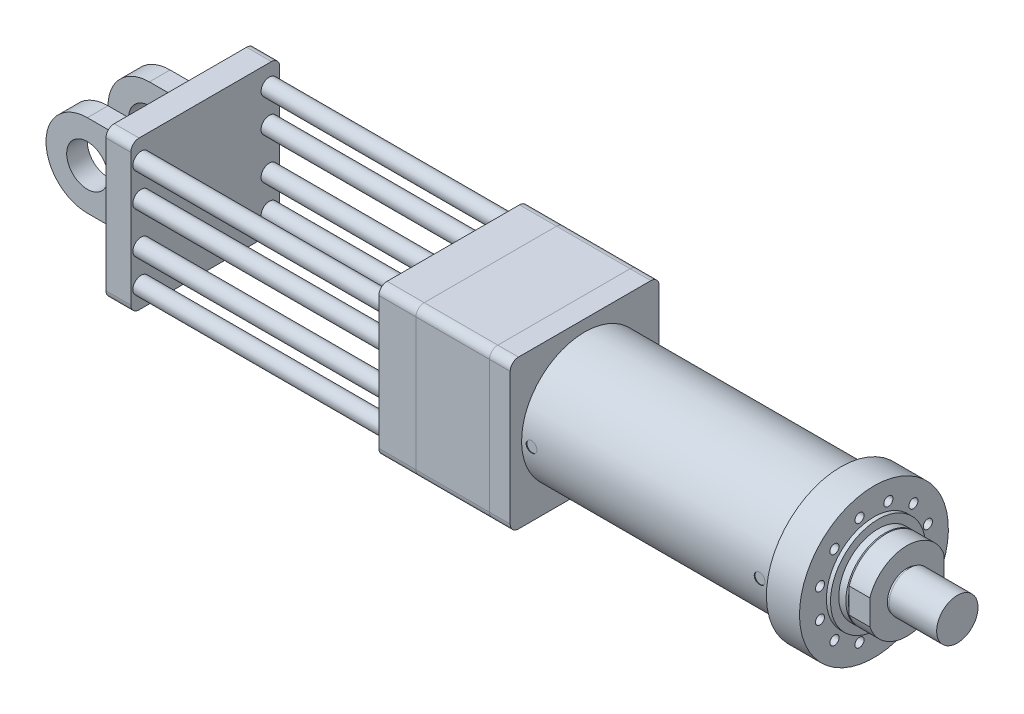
from build123d import *

# Parameters (mm, degrees)
SKETCH_2_W          = 619.5
SKETCH_2_H          = 152.5
SKETCH_3_R          = 180
SKETCH_3_R_2        = 11
EXTRUDE_1_DEPTH     = 80
SKETCH_4_R          = 115
EXTRUDE_2_DEPTH     = 10
SKETCH_5_R          = 95
EXTRUDE_3_DEPTH     = 20
CHAMFER_1_SIZE      = 3
SKETCH_17_R         = 13
CUT_EXTRUDE_6_DEPTH = 2
SKETCH_19_R         = 13
CUT_EXTRUDE_7_DEPTH = 2
SKETCH_23_W         = 360
SKETCH_23_H         = 360
EXTRUDE_8_DEPTH     = 50
EXTRUDE_9_DEPTH     = 50
SKETCH_25_R         = 47.5
EXTRUDE_10_DEPTH    = 5
SKETCH_26_R         = 50
EXTRUDE_11_DEPTH    = 115
SKETCH_28_W         = 360
SKETCH_28_H         = 360
EXTRUDE_12_DEPTH    = 178
SKETCH_29_W         = 360
SKETCH_29_H         = 360
EXTRUDE_13_DEPTH    = 89.5
FILLET_1_R          = 20
FILLET_2_R          = 20
FILLET_3_R          = 20
SKETCH_30_R         = 20
EXTRUDE_14_DEPTH    = 600
SKETCH_31_W         = 360
SKETCH_31_H         = 360
EXTRUDE_15_DEPTH    = 60
FILLET_4_R          = 20
SKETCH_32_W         = 50
SKETCH_32_H         = 200
EXTRUDE_16_DEPTH    = 225
SKETCH_33_R         = 50
CUT_EXTRUDE_8_DEPTH = 225


with BuildPart() as part:
    # Sketch 2 → Revolve 1 (revolve)
    with BuildSketch(Plane.XY):
        with Locations((309.75, 76.25)):
            Rectangle(SKETCH_2_W, SKETCH_2_H)
    revolve(axis=Axis((619.5, 0, 0), (-1, 0, 0)))

    # Sketch 3 → Extrude 1 (add)
    with BuildSketch(Plane(origin=(619.5, 0, 0), x_dir=(0, 0, -1), z_dir=(1, 0, 0))):
        with Locations(Location((0, 0, 0), (0, 0, 90))):
            Circle(SKETCH_3_R)
        with Locations(Location((130.399986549, 34.940571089, 0), (0, 0, 90))):
            Circle(SKETCH_3_R_2, mode=Mode.SUBTRACT)
        with Locations(Location((130.399986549, -34.940571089, 0), (0, 0, 90))):
            Circle(SKETCH_3_R_2, mode=Mode.SUBTRACT)
        with Locations(Location((95.45941546, -95.45941546, 0), (0, 0, 90))):
            Circle(SKETCH_3_R_2, mode=Mode.SUBTRACT)
        with Locations(Location((34.940571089, -130.399986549, 0), (0, 0, 90))):
            Circle(SKETCH_3_R_2, mode=Mode.SUBTRACT)
        with Locations(Location((-34.940571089, -130.399986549, 0), (0, 0, 90))):
            Circle(SKETCH_3_R_2, mode=Mode.SUBTRACT)
        with Locations(Location((-95.45941546, -95.45941546, 0), (0, 0, 90))):
            Circle(SKETCH_3_R_2, mode=Mode.SUBTRACT)
        with Locations(Location((-130.399986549, -34.940571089, 0), (0, 0, 90))):
            Circle(SKETCH_3_R_2, mode=Mode.SUBTRACT)
        with Locations(Location((-130.399986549, 34.940571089, 0), (0, 0, 90))):
            Circle(SKETCH_3_R_2, mode=Mode.SUBTRACT)
        with Locations(Location((-95.45941546, 95.45941546, 0), (0, 0, 90))):
            Circle(SKETCH_3_R_2, mode=Mode.SUBTRACT)
        with Locations(Location((-34.940571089, 130.399986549, 0), (0, 0, 90))):
            Circle(SKETCH_3_R_2, mode=Mode.SUBTRACT)
        with Locations(Location((34.940571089, 130.399986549, 0), (0, 0, 90))):
            Circle(SKETCH_3_R_2, mode=Mode.SUBTRACT)
        with Locations(Location((95.45941546, 95.45941546, 0), (0, 0, 90))):
            Circle(SKETCH_3_R_2, mode=Mode.SUBTRACT)
    extrude(amount=EXTRUDE_1_DEPTH)

    # Sketch 4 → Extrude 2 (add)
    with BuildSketch(Plane(origin=(699.5, 0, 0), x_dir=(0, 0, -1), z_dir=(1, 0, 0))):
        with Locations(Location((0, 0, 0), (0, 0, 90))):
            Circle(SKETCH_4_R)
    extrude(amount=EXTRUDE_2_DEPTH)

    # Sketch 5 → Extrude 3 (add)
    with BuildSketch(Plane(origin=(709.5, 0, 0), x_dir=(0, 0, -1), z_dir=(1, 0, 0))):
        with Locations(Location((0, 0, 0), (0, 0, 90))):
            Circle(SKETCH_5_R)
    extrude(amount=EXTRUDE_3_DEPTH)

    # Chamfer 1
    chamfer_1_edges = [part.edges().sort_by_distance(p)[0] for p in [
        (729.5, -95, 0),
    ]]
    chamfer(chamfer_1_edges, length=CHAMFER_1_SIZE)

    # Sketch 17 → Cut-Extrude 6 (cut)
    with BuildSketch(Plane.XY.offset(-152.5)):
        with Locations(Location((44, 0, 0), (0, 0, 180))):
            Circle(SKETCH_17_R)
    extrude(amount=CUT_EXTRUDE_6_DEPTH, mode=Mode.SUBTRACT)

    # Sketch 19 → Cut-Extrude 7 (cut)
    with BuildSketch(Plane.XY.offset(152.5)):
        with Locations((24, 0)):
            Circle(SKETCH_19_R)
        with Locations((575.5, 0)):
            Circle(SKETCH_19_R)
    extrude(amount=-CUT_EXTRUDE_7_DEPTH, mode=Mode.SUBTRACT)

    # Sketch 23 → Extrude 8 (add)
    with BuildSketch(Plane.ZY):
        Rectangle(SKETCH_23_W, SKETCH_23_H)
    extrude(amount=EXTRUDE_8_DEPTH)

    # Sketch 24 → Extrude 9 (add)
    with BuildSketch(Plane(origin=(729.5, 0, 0), x_dir=(0, 0, -1), z_dir=(1, 0, 0))):
        with BuildLine():
            Line((-90, 30.413812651), (-90, -30.413812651))
            ThreePointArc((-90, -30.413812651), (0, -95), (90, -30.413812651))
            Line((90, -30.413812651), (90, 30.413812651))
            ThreePointArc((90, 30.413812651), (0, 95), (-90, 30.413812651))
        make_face()
    extrude(amount=EXTRUDE_9_DEPTH)

    # Sketch 25 → Extrude 10 (add)
    with BuildSketch(Plane(origin=(779.5, 0, 0), x_dir=(0, 0, -1), z_dir=(1, 0, 0))):
        with Locations(Location((0, 0, 0), (0, 0, 90))):
            Circle(SKETCH_25_R)
    extrude(amount=EXTRUDE_10_DEPTH)

    # Sketch 26 → Extrude 11 (add)
    with BuildSketch(Plane(origin=(784.5, 0, 0), x_dir=(0, 0, -1), z_dir=(1, 0, 0))):
        with Locations(Location((1.643994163, 0, 0), (0, 0, 90))):
            Circle(SKETCH_26_R)
    extrude(amount=EXTRUDE_11_DEPTH)

    # Fillet 1
    fillet_1_edges = [part.edges().sort_by_distance(p)[0] for p in [
        (-25, -180, 180),
        (-25, 180, 180),
        (-25, 180, -180),
        (-25, -180, -180),
    ]]
    fillet(fillet_1_edges, radius=FILLET_1_R)


with BuildPart() as body_2:
    # Sketch 28 → Extrude 12 (new body)
    with BuildSketch(Plane.ZY.offset(50)):
        Rectangle(SKETCH_28_W, SKETCH_28_H)
    extrude(amount=EXTRUDE_12_DEPTH)

    # Fillet 2
    fillet_2_edges = [body_2.edges().sort_by_distance(p)[0] for p in [
        (-139, -180, 180),
        (-139, -180, -180),
        (-139, 180, -180),
        (-139, 180, 180),
    ]]
    fillet(fillet_2_edges, radius=FILLET_2_R)


with BuildPart() as body_3:
    # Sketch 29 → Extrude 13 (new body)
    with BuildSketch(Plane.ZY.offset(228)):
        Rectangle(SKETCH_29_W, SKETCH_29_H)
    extrude(amount=EXTRUDE_13_DEPTH)

    # Fillet 3
    fillet_3_edges = [body_3.edges().sort_by_distance(p)[0] for p in [
        (-272.75, -180, 180),
        (-272.75, -180, -180),
        (-272.75, 180, -180),
        (-272.75, 180, 180),
    ]]
    fillet(fillet_3_edges, radius=FILLET_3_R)

    # Sketch 30 → Extrude 14 (add)
    with BuildSketch(Plane.ZY.offset(317.5)):
        with Locations(Location((-155, 130, 0), (0, 0, 270))):
            Circle(SKETCH_30_R)
        with Locations(Location((-155, 50, 0), (0, 0, 270))):
            Circle(SKETCH_30_R)
        with Locations(Location((-155, -50, 0), (0, 0, 270))):
            Circle(SKETCH_30_R)
        with Locations(Location((-155, -130, 0), (0, 0, 270))):
            Circle(SKETCH_30_R)
        with Locations(Location((155, -130, 0), (0, 0, 90))):
            Circle(SKETCH_30_R)
        with Locations(Location((155, -50, 0), (0, 0, 90))):
            Circle(SKETCH_30_R)
        with Locations(Location((155, 50, 0), (0, 0, 90))):
            Circle(SKETCH_30_R)
        with Locations(Location((155, 130, 0), (0, 0, 90))):
            Circle(SKETCH_30_R)
    extrude(amount=EXTRUDE_14_DEPTH)

    # Sketch 31 → Extrude 15 (add)
    with BuildSketch(Plane.ZY.offset(917.5)):
        Rectangle(SKETCH_31_W, SKETCH_31_H)
    extrude(amount=EXTRUDE_15_DEPTH)

    # Fillet 4
    fillet_4_edges = [body_3.edges().sort_by_distance(p)[0] for p in [
        (-947.5, -180, 180),
        (-947.5, 180, 180),
        (-947.5, 180, -180),
        (-947.5, -180, -180),
    ]]
    fillet(fillet_4_edges, radius=FILLET_4_R)

    # Sketch 32 → Extrude 16 (add)
    with BuildSketch(Plane.ZY.offset(977.5)):
        with Locations((-75, 0)):
            Rectangle(SKETCH_32_W, SKETCH_32_H)
        with Locations((75, 0)):
            Rectangle(SKETCH_32_W, SKETCH_32_H)
    extrude(amount=EXTRUDE_16_DEPTH)

    # Sketch 33 → Cut-Extrude 8 (cut)
    with BuildSketch(Plane.XY.offset(100)):
        with Locations((-1102.5, 0)):
            Circle(SKETCH_33_R)
        with BuildLine():
            Line((-1102.5, 100), (-1310.057326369, 175.43685795))
            Line((-1310.057326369, 175.43685795), (-1310.057326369, -219.026528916))
            Line((-1310.057326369, -219.026528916), (-1102.5, -100))
            ThreePointArc((-1102.5, -100), (-1202.5, 0), (-1102.5, 100))
        make_face()
    extrude(amount=-CUT_EXTRUDE_8_DEPTH, mode=Mode.SUBTRACT)


solid = Compound([part.part, body_2.part, body_3.part])
